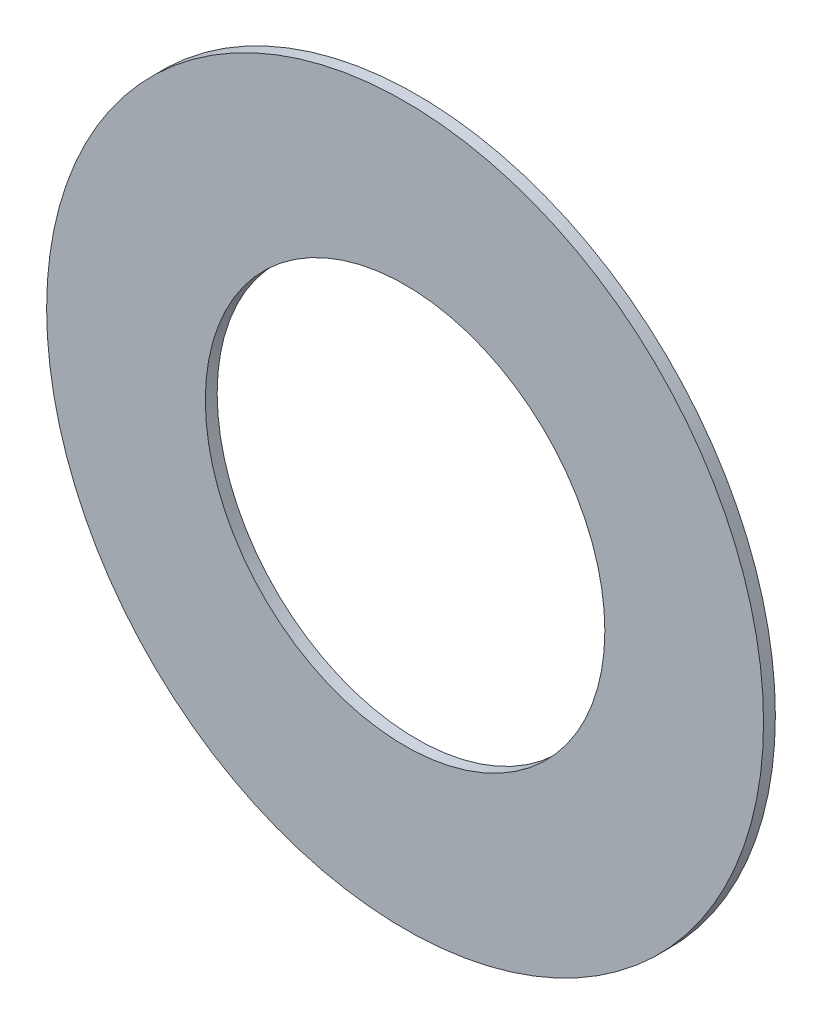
from build123d import *

# Parameters (mm, degrees)
SKETCH2_R           = 96.171268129
SKETCH2_R_2         = 53.594
BOSS_EXTRUDE1_DEPTH = 1.5875


with BuildPart() as part:
    # Sketch2 → Boss-Extrude1 (new, symmetric)
    with BuildSketch(Plane(origin=(0, 0, 0), x_dir=(0, 1, 0), z_dir=(0, 0, 1))):
        with Locations(Location((0, 0, 0), (0, 0, 270))):
            Circle(SKETCH2_R)
        with Locations(Location((0, 0, 0), (0, 0, 270))):
            Circle(SKETCH2_R_2, mode=Mode.SUBTRACT)
    extrude(amount=BOSS_EXTRUDE1_DEPTH, both=True)


solid = part.part
